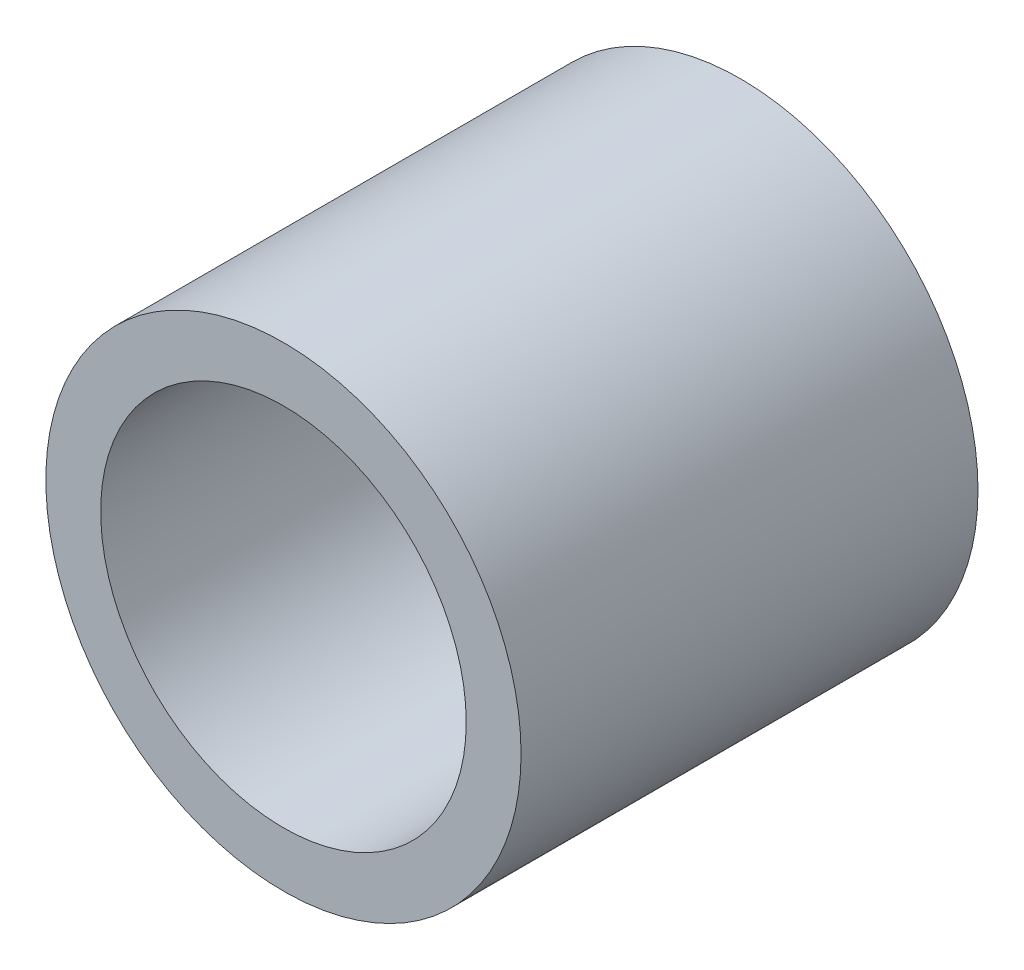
from build123d import *

# Parameters (mm, degrees)
ESQUISSE1_R      = 13
ESQUISSE1_R_2    = 10
EXTRUSION1_DEPTH = 12.5


with BuildPart() as part:
    # Esquisse1 → Extrusion1 (new, symmetric)
    with BuildSketch(Plane.XY):
        Circle(ESQUISSE1_R)
        Circle(ESQUISSE1_R_2, mode=Mode.SUBTRACT)
    extrude(amount=EXTRUSION1_DEPTH, both=True)


solid = part.part
